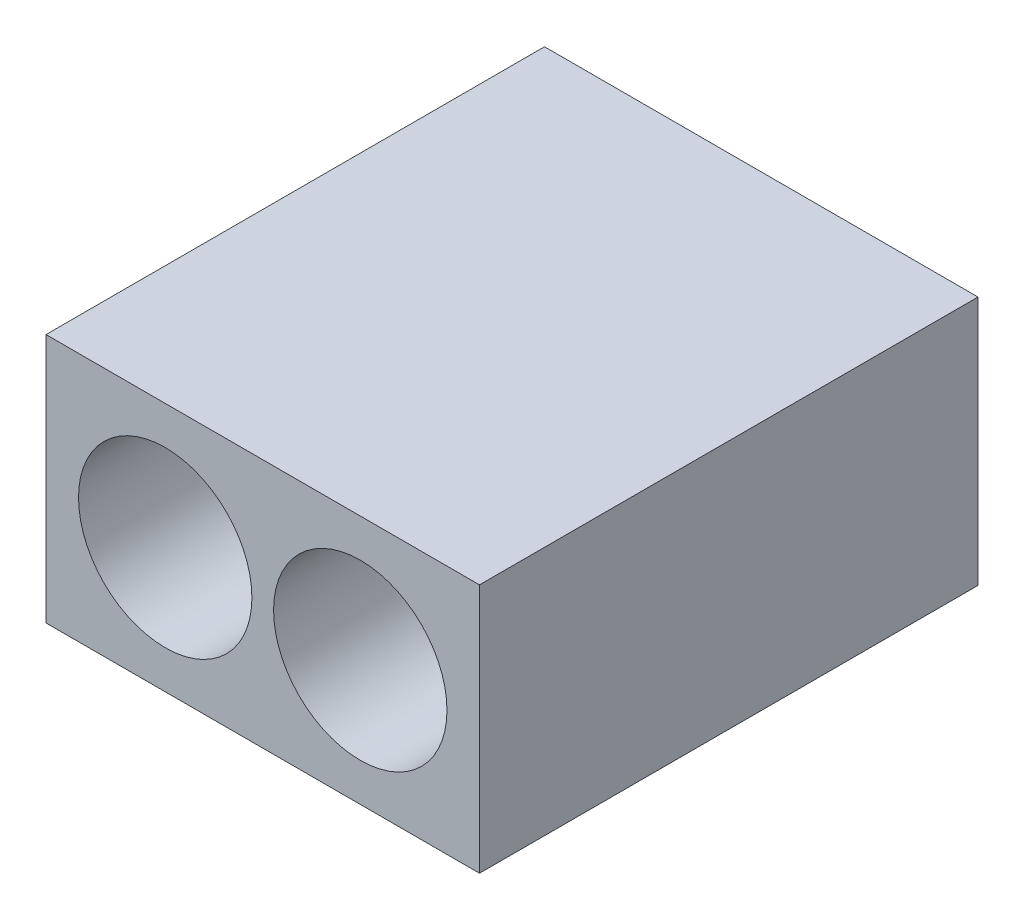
from build123d import *

# Parameters (mm, degrees)
SKETCH1_W                      = 20
SKETCH1_H                      = 11.524
BOSS_EXTRUDE1_DEPTH            = 23
CBORE_FOR_M4_SHCS1_D           = 4.5
CBORE_FOR_M4_SHCS1_CBORE_D     = 8
CBORE_FOR_M4_SHCS1_CBORE_DEPTH = 9


with BuildPart() as part:
    # Sketch1 → Boss-Extrude1 (new body)
    with BuildSketch(Plane.XY):
        Rectangle(SKETCH1_W, SKETCH1_H)
    extrude(amount=BOSS_EXTRUDE1_DEPTH)

    # CBORE for M4 SHCS1 (through all)
    with Locations(Plane.XY.offset(23)):
        with Locations((-4.5, 0), (4.5, 0)):
            CounterBoreHole(CBORE_FOR_M4_SHCS1_D / 2, CBORE_FOR_M4_SHCS1_CBORE_D / 2, CBORE_FOR_M4_SHCS1_CBORE_DEPTH)


solid = part.part
